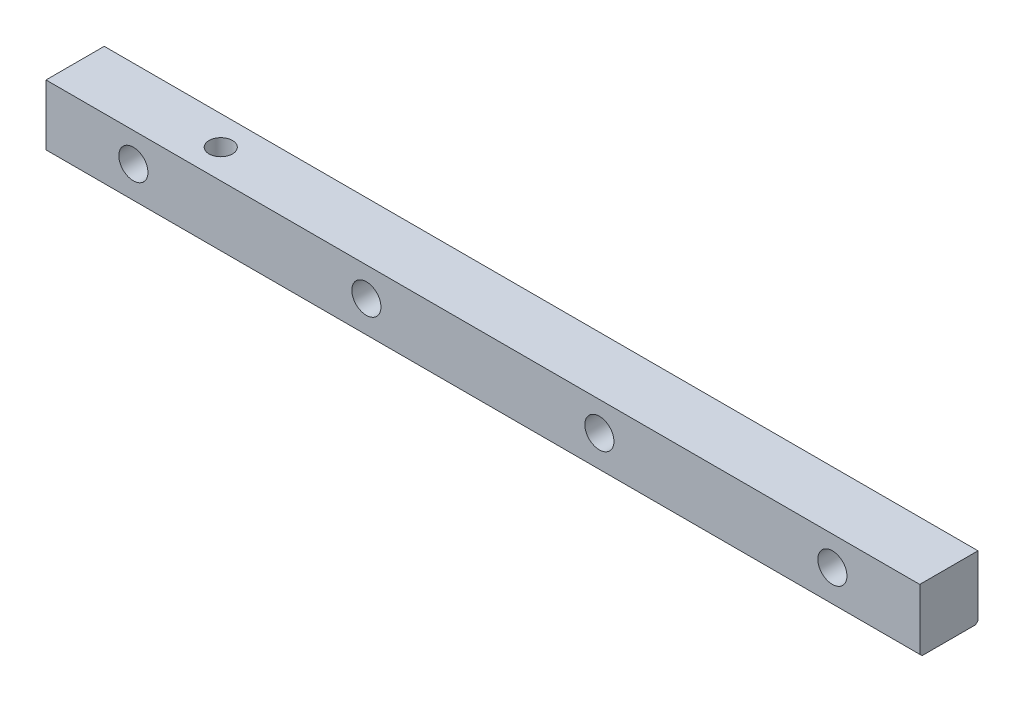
ISO-10303-21;
HEADER;
FILE_DESCRIPTION(('STEP AP214'),'2;1');
FILE_NAME('part.step','',(''),(''),'','','');
FILE_SCHEMA(('AUTOMOTIVE_DESIGN { 1 0 10303 214 1 1 1 1 }'));
ENDSEC;
DATA;
#1=APPLICATION_CONTEXT('core data for automotive mechanical design processes');
#2=APPLICATION_PROTOCOL_DEFINITION('international standard','automotive_design',2000,#1);
#3=PRODUCT_CONTEXT('',#1,'mechanical');
#4=PRODUCT('Part','Part','',(#3));
#5=PRODUCT_RELATED_PRODUCT_CATEGORY('part','',(#4));
#6=PRODUCT_DEFINITION_FORMATION('','',#4);
#7=PRODUCT_DEFINITION_CONTEXT('part definition',#1,'design');
#8=PRODUCT_DEFINITION('design','',#6,#7);
#9=PRODUCT_DEFINITION_SHAPE('','',#8);
#10=(LENGTH_UNIT() NAMED_UNIT(*) SI_UNIT(.MILLI.,.METRE.));
#11=(NAMED_UNIT(*) PLANE_ANGLE_UNIT() SI_UNIT($,.RADIAN.));
#12=(NAMED_UNIT(*) SI_UNIT($,.STERADIAN.) SOLID_ANGLE_UNIT());
#13=UNCERTAINTY_MEASURE_WITH_UNIT(LENGTH_MEASURE(1.E-05),#10,'distance_accuracy_value','');
#14=(GEOMETRIC_REPRESENTATION_CONTEXT(3) GLOBAL_UNCERTAINTY_ASSIGNED_CONTEXT((#13)) GLOBAL_UNIT_ASSIGNED_CONTEXT((#10,
#11,#12)) REPRESENTATION_CONTEXT('',''));
#15=CARTESIAN_POINT('',(0.,0.,0.));
#16=DIRECTION('',(0.,0.,1.));
#17=DIRECTION('',(1.,0.,0.));
#18=AXIS2_PLACEMENT_3D('',#15,#16,#17);
#19=CARTESIAN_POINT('',(-209.55,210.01,12.7));
#20=DIRECTION('',(1.,0.,0.));
#21=DIRECTION('',(0.,0.,-1.));
#22=AXIS2_PLACEMENT_3D('',#19,#20,#21);
#23=PLANE('',#22);
#24=DIRECTION('',(0.,-1.,0.));
#25=VECTOR('',#24,1.);
#26=CARTESIAN_POINT('',(-209.55,210.01,0.));
#27=LINE('',#26,#25);
#28=CARTESIAN_POINT('',(-209.55,210.01,0.));
#29=VERTEX_POINT('',#28);
#30=CARTESIAN_POINT('',(-209.55,196.802,0.));
#31=VERTEX_POINT('',#30);
#32=EDGE_CURVE('E133',#29,#31,#27,.T.);
#33=ORIENTED_EDGE('',*,*,#32,.T.);
#34=DIRECTION('',(0.,0.707106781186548,-0.707106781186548));
#35=VECTOR('',#34,1.);
#36=CARTESIAN_POINT('',(-209.55,196.294,0.508000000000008));
#37=LINE('',#36,#35);
#38=CARTESIAN_POINT('',(-209.55,196.294,0.508000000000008));
#39=VERTEX_POINT('',#38);
#40=EDGE_CURVE('E54',#31,#39,#37,.F.);
#41=ORIENTED_EDGE('',*,*,#40,.T.);
#42=DIRECTION('',(0.,0.,-1.));
#43=VECTOR('',#42,1.);
#44=CARTESIAN_POINT('',(-209.55,196.294,12.7));
#45=LINE('',#44,#43);
#46=CARTESIAN_POINT('',(-209.55,196.294,12.192));
#47=VERTEX_POINT('',#46);
#48=EDGE_CURVE('E144',#47,#39,#45,.T.);
#49=ORIENTED_EDGE('',*,*,#48,.F.);
#50=DIRECTION('',(0.,0.707106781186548,0.707106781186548));
#51=VECTOR('',#50,1.);
#52=CARTESIAN_POINT('',(-209.55,196.802,12.7));
#53=LINE('',#52,#51);
#54=CARTESIAN_POINT('',(-209.55,196.802,12.7));
#55=VERTEX_POINT('',#54);
#56=EDGE_CURVE('E61',#47,#55,#53,.T.);
#57=ORIENTED_EDGE('',*,*,#56,.T.);
#58=DIRECTION('',(0.,-1.,0.));
#59=VECTOR('',#58,1.);
#60=CARTESIAN_POINT('',(-209.55,210.01,12.7));
#61=LINE('',#60,#59);
#62=CARTESIAN_POINT('',(-209.55,210.01,12.7));
#63=VERTEX_POINT('',#62);
#64=EDGE_CURVE('E111',#63,#55,#61,.T.);
#65=ORIENTED_EDGE('',*,*,#64,.F.);
#66=DIRECTION('',(0.,0.,-1.));
#67=VECTOR('',#66,1.);
#68=CARTESIAN_POINT('',(-209.55,210.01,12.7));
#69=LINE('',#68,#67);
#70=EDGE_CURVE('E122',#63,#29,#69,.T.);
#71=ORIENTED_EDGE('',*,*,#70,.T.);
#72=EDGE_LOOP('',(#33,#41,#49,#57,#65,#71));
#73=FACE_BOUND('',#72,.T.);
#74=ADVANCED_FACE('F45',(#73),#23,.F.);
#75=CARTESIAN_POINT('',(-209.55,196.294,12.7));
#76=DIRECTION('',(0.,1.,0.));
#77=DIRECTION('',(0.,0.,1.));
#78=AXIS2_PLACEMENT_3D('',#75,#76,#77);
#79=PLANE('',#78);
#80=CARTESIAN_POINT('',(-177.8,196.294,6.34999999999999));
#81=DIRECTION('',(0.,1.,0.));
#82=DIRECTION('',(-1.,0.,0.));
#83=AXIS2_PLACEMENT_3D('',#80,#81,#82);
#84=CIRCLE('',#83,2.55269999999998);
#85=CARTESIAN_POINT('',(-180.3527,196.294,6.34999999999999));
#86=VERTEX_POINT('',#85);
#87=EDGE_CURVE('E206',#86,#86,#84,.T.);
#88=ORIENTED_EDGE('',*,*,#87,.T.);
#89=EDGE_LOOP('',(#88));
#90=FACE_BOUND('',#89,.T.);
#91=ORIENTED_EDGE('',*,*,#48,.T.);
#92=DIRECTION('',(1.,0.,0.));
#93=VECTOR('',#92,1.);
#94=CARTESIAN_POINT('',(-209.55,196.294,0.508000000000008));
#95=LINE('',#94,#93);
#96=CARTESIAN_POINT('',(-19.05,196.294,0.508000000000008));
#97=VERTEX_POINT('',#96);
#98=EDGE_CURVE('E151',#39,#97,#95,.T.);
#99=ORIENTED_EDGE('',*,*,#98,.T.);
#100=DIRECTION('',(0.,0.,-1.));
#101=VECTOR('',#100,1.);
#102=CARTESIAN_POINT('',(-19.05,196.294,12.7));
#103=LINE('',#102,#101);
#104=CARTESIAN_POINT('',(-19.05,196.294,12.192));
#105=VERTEX_POINT('',#104);
#106=EDGE_CURVE('E121',#105,#97,#103,.T.);
#107=ORIENTED_EDGE('',*,*,#106,.F.);
#108=DIRECTION('',(-1.,0.,0.));
#109=VECTOR('',#108,1.);
#110=CARTESIAN_POINT('',(-209.55,196.294,12.192));
#111=LINE('',#110,#109);
#112=EDGE_CURVE('E148',#105,#47,#111,.T.);
#113=ORIENTED_EDGE('',*,*,#112,.T.);
#114=EDGE_LOOP('',(#91,#99,#107,#113));
#115=FACE_BOUND('',#114,.T.);
#116=ADVANCED_FACE('F170',(#90,#115),#79,.F.);
#117=CARTESIAN_POINT('',(-19.05,210.01,12.7));
#118=DIRECTION('',(-1.,0.,0.));
#119=DIRECTION('',(0.,0.,1.));
#120=AXIS2_PLACEMENT_3D('',#117,#118,#119);
#121=PLANE('',#120);
#122=ORIENTED_EDGE('',*,*,#106,.T.);
#123=DIRECTION('',(0.,-0.707106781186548,0.707106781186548));
#124=VECTOR('',#123,1.);
#125=CARTESIAN_POINT('',(-19.05,196.294,0.508000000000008));
#126=LINE('',#125,#124);
#127=CARTESIAN_POINT('',(-19.05,196.802,0.));
#128=VERTEX_POINT('',#127);
#129=EDGE_CURVE('E158',#97,#128,#126,.F.);
#130=ORIENTED_EDGE('',*,*,#129,.T.);
#131=DIRECTION('',(0.,1.,0.));
#132=VECTOR('',#131,1.);
#133=CARTESIAN_POINT('',(-19.05,210.01,0.));
#134=LINE('',#133,#132);
#135=CARTESIAN_POINT('',(-19.05,210.01,0.));
#136=VERTEX_POINT('',#135);
#137=EDGE_CURVE('E117',#128,#136,#134,.T.);
#138=ORIENTED_EDGE('',*,*,#137,.T.);
#139=DIRECTION('',(0.,0.,-1.));
#140=VECTOR('',#139,1.);
#141=CARTESIAN_POINT('',(-19.05,210.01,12.7));
#142=LINE('',#141,#140);
#143=CARTESIAN_POINT('',(-19.05,210.01,12.7));
#144=VERTEX_POINT('',#143);
#145=EDGE_CURVE('E114',#144,#136,#142,.T.);
#146=ORIENTED_EDGE('',*,*,#145,.F.);
#147=DIRECTION('',(0.,1.,0.));
#148=VECTOR('',#147,1.);
#149=CARTESIAN_POINT('',(-19.05,210.01,12.7));
#150=LINE('',#149,#148);
#151=CARTESIAN_POINT('',(-19.05,196.802,12.7));
#152=VERTEX_POINT('',#151);
#153=EDGE_CURVE('E102',#152,#144,#150,.T.);
#154=ORIENTED_EDGE('',*,*,#153,.F.);
#155=DIRECTION('',(0.,-0.707106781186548,-0.707106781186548));
#156=VECTOR('',#155,1.);
#157=CARTESIAN_POINT('',(-19.05,196.802,12.7));
#158=LINE('',#157,#156);
#159=EDGE_CURVE('E155',#152,#105,#158,.T.);
#160=ORIENTED_EDGE('',*,*,#159,.T.);
#161=EDGE_LOOP('',(#122,#130,#138,#146,#154,#160));
#162=FACE_BOUND('',#161,.T.);
#163=ADVANCED_FACE('F116',(#162),#121,.F.);
#164=CARTESIAN_POINT('',(-209.55,210.01,12.7));
#165=DIRECTION('',(0.,-1.,0.));
#166=DIRECTION('',(1.,0.,0.));
#167=AXIS2_PLACEMENT_3D('',#164,#165,#166);
#168=PLANE('',#167);
#169=CARTESIAN_POINT('',(-177.8,210.01,6.34999999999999));
#170=DIRECTION('',(0.,1.,0.));
#171=DIRECTION('',(-1.,0.,0.));
#172=AXIS2_PLACEMENT_3D('',#169,#170,#171);
#173=CIRCLE('',#172,2.55269999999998);
#174=CARTESIAN_POINT('',(-180.3527,210.01,6.34999999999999));
#175=VERTEX_POINT('',#174);
#176=EDGE_CURVE('E210',#175,#175,#173,.T.);
#177=ORIENTED_EDGE('',*,*,#176,.F.);
#178=EDGE_LOOP('',(#177));
#179=FACE_BOUND('',#178,.T.);
#180=DIRECTION('',(-1.,0.,0.));
#181=VECTOR('',#180,1.);
#182=CARTESIAN_POINT('',(-209.55,210.01,0.));
#183=LINE('',#182,#181);
#184=EDGE_CURVE('E139',#136,#29,#183,.T.);
#185=ORIENTED_EDGE('',*,*,#184,.T.);
#186=ORIENTED_EDGE('',*,*,#70,.F.);
#187=DIRECTION('',(-1.,0.,0.));
#188=VECTOR('',#187,1.);
#189=CARTESIAN_POINT('',(-209.55,210.01,12.7));
#190=LINE('',#189,#188);
#191=EDGE_CURVE('E106',#144,#63,#190,.T.);
#192=ORIENTED_EDGE('',*,*,#191,.F.);
#193=ORIENTED_EDGE('',*,*,#145,.T.);
#194=EDGE_LOOP('',(#185,#186,#192,#193));
#195=FACE_BOUND('',#194,.T.);
#196=ADVANCED_FACE('F124',(#179,#195),#168,.F.);
#197=CARTESIAN_POINT('',(-209.55,196.294,12.7));
#198=DIRECTION('',(0.,0.,1.));
#199=DIRECTION('',(1.,0.,0.));
#200=AXIS2_PLACEMENT_3D('',#197,#198,#199);
#201=PLANE('',#200);
#202=CARTESIAN_POINT('',(-38.1,203.66,12.7));
#203=DIRECTION('',(0.,0.,1.));
#204=DIRECTION('',(1.,0.,0.));
#205=AXIS2_PLACEMENT_3D('',#202,#203,#204);
#206=CIRCLE('',#205,3.175);
#207=CARTESIAN_POINT('',(-34.925,203.66,12.7));
#208=VERTEX_POINT('',#207);
#209=EDGE_CURVE('E202',#208,#208,#206,.T.);
#210=ORIENTED_EDGE('',*,*,#209,.F.);
#211=EDGE_LOOP('',(#210));
#212=FACE_BOUND('',#211,.T.);
#213=CARTESIAN_POINT('',(-88.9,203.66,12.7));
#214=DIRECTION('',(0.,0.,1.));
#215=DIRECTION('',(1.,0.,0.));
#216=AXIS2_PLACEMENT_3D('',#213,#214,#215);
#217=CIRCLE('',#216,3.175);
#218=CARTESIAN_POINT('',(-85.725,203.66,12.7));
#219=VERTEX_POINT('',#218);
#220=EDGE_CURVE('E194',#219,#219,#217,.T.);
#221=ORIENTED_EDGE('',*,*,#220,.F.);
#222=EDGE_LOOP('',(#221));
#223=FACE_BOUND('',#222,.T.);
#224=CARTESIAN_POINT('',(-139.7,203.66,12.7));
#225=DIRECTION('',(0.,0.,1.));
#226=DIRECTION('',(1.,0.,0.));
#227=AXIS2_PLACEMENT_3D('',#224,#225,#226);
#228=CIRCLE('',#227,3.175);
#229=CARTESIAN_POINT('',(-136.525,203.66,12.7));
#230=VERTEX_POINT('',#229);
#231=EDGE_CURVE('E186',#230,#230,#228,.T.);
#232=ORIENTED_EDGE('',*,*,#231,.F.);
#233=EDGE_LOOP('',(#232));
#234=FACE_BOUND('',#233,.T.);
#235=CARTESIAN_POINT('',(-190.5,203.66,12.7));
#236=DIRECTION('',(0.,0.,1.));
#237=DIRECTION('',(1.,0.,0.));
#238=AXIS2_PLACEMENT_3D('',#235,#236,#237);
#239=CIRCLE('',#238,3.175);
#240=CARTESIAN_POINT('',(-187.325,203.66,12.7));
#241=VERTEX_POINT('',#240);
#242=EDGE_CURVE('E178',#241,#241,#239,.T.);
#243=ORIENTED_EDGE('',*,*,#242,.F.);
#244=EDGE_LOOP('',(#243));
#245=FACE_BOUND('',#244,.T.);
#246=ORIENTED_EDGE('',*,*,#64,.T.);
#247=DIRECTION('',(1.,0.,0.));
#248=VECTOR('',#247,1.);
#249=CARTESIAN_POINT('',(-19.05,196.802,12.7));
#250=LINE('',#249,#248);
#251=EDGE_CURVE('E11',#55,#152,#250,.T.);
#252=ORIENTED_EDGE('',*,*,#251,.T.);
#253=ORIENTED_EDGE('',*,*,#153,.T.);
#254=ORIENTED_EDGE('',*,*,#191,.T.);
#255=EDGE_LOOP('',(#246,#252,#253,#254));
#256=FACE_BOUND('',#255,.T.);
#257=ADVANCED_FACE('F104',(#212,#223,#234,#245,#256),#201,.T.);
#258=CARTESIAN_POINT('',(-209.55,196.294,0.));
#259=DIRECTION('',(0.,0.,1.));
#260=DIRECTION('',(1.,0.,0.));
#261=AXIS2_PLACEMENT_3D('',#258,#259,#260);
#262=PLANE('',#261);
#263=CARTESIAN_POINT('',(-38.1,203.66,0.));
#264=DIRECTION('',(0.,0.,1.));
#265=DIRECTION('',(1.,0.,0.));
#266=AXIS2_PLACEMENT_3D('',#263,#264,#265);
#267=CIRCLE('',#266,3.175);
#268=CARTESIAN_POINT('',(-34.925,203.66,0.));
#269=VERTEX_POINT('',#268);
#270=EDGE_CURVE('E198',#269,#269,#267,.T.);
#271=ORIENTED_EDGE('',*,*,#270,.T.);
#272=EDGE_LOOP('',(#271));
#273=FACE_BOUND('',#272,.T.);
#274=CARTESIAN_POINT('',(-88.9,203.66,0.));
#275=DIRECTION('',(0.,0.,1.));
#276=DIRECTION('',(1.,0.,0.));
#277=AXIS2_PLACEMENT_3D('',#274,#275,#276);
#278=CIRCLE('',#277,3.175);
#279=CARTESIAN_POINT('',(-85.725,203.66,0.));
#280=VERTEX_POINT('',#279);
#281=EDGE_CURVE('E190',#280,#280,#278,.T.);
#282=ORIENTED_EDGE('',*,*,#281,.T.);
#283=EDGE_LOOP('',(#282));
#284=FACE_BOUND('',#283,.T.);
#285=CARTESIAN_POINT('',(-139.7,203.66,0.));
#286=DIRECTION('',(0.,0.,1.));
#287=DIRECTION('',(1.,0.,0.));
#288=AXIS2_PLACEMENT_3D('',#285,#286,#287);
#289=CIRCLE('',#288,3.175);
#290=CARTESIAN_POINT('',(-136.525,203.66,0.));
#291=VERTEX_POINT('',#290);
#292=EDGE_CURVE('E182',#291,#291,#289,.T.);
#293=ORIENTED_EDGE('',*,*,#292,.T.);
#294=EDGE_LOOP('',(#293));
#295=FACE_BOUND('',#294,.T.);
#296=CARTESIAN_POINT('',(-190.5,203.66,0.));
#297=DIRECTION('',(0.,0.,1.));
#298=DIRECTION('',(1.,0.,0.));
#299=AXIS2_PLACEMENT_3D('',#296,#297,#298);
#300=CIRCLE('',#299,3.175);
#301=CARTESIAN_POINT('',(-187.325,203.66,0.));
#302=VERTEX_POINT('',#301);
#303=EDGE_CURVE('E136',#302,#302,#300,.T.);
#304=ORIENTED_EDGE('',*,*,#303,.T.);
#305=EDGE_LOOP('',(#304));
#306=FACE_BOUND('',#305,.T.);
#307=ORIENTED_EDGE('',*,*,#137,.F.);
#308=DIRECTION('',(-1.,0.,0.));
#309=VECTOR('',#308,1.);
#310=CARTESIAN_POINT('',(-209.55,196.802,0.));
#311=LINE('',#310,#309);
#312=EDGE_CURVE('E69',#128,#31,#311,.T.);
#313=ORIENTED_EDGE('',*,*,#312,.T.);
#314=ORIENTED_EDGE('',*,*,#32,.F.);
#315=ORIENTED_EDGE('',*,*,#184,.F.);
#316=EDGE_LOOP('',(#307,#313,#314,#315));
#317=FACE_BOUND('',#316,.T.);
#318=ADVANCED_FACE('F174',(#273,#284,#295,#306,#317),#262,.F.);
#319=CARTESIAN_POINT('',(-190.5,203.66,0.));
#320=DIRECTION('',(0.,0.,1.));
#321=DIRECTION('',(1.,0.,0.));
#322=AXIS2_PLACEMENT_3D('',#319,#320,#321);
#323=CYLINDRICAL_SURFACE('',#322,3.175);
#324=ORIENTED_EDGE('',*,*,#303,.F.);
#325=EDGE_LOOP('',(#324));
#326=FACE_BOUND('',#325,.T.);
#327=ORIENTED_EDGE('',*,*,#242,.T.);
#328=EDGE_LOOP('',(#327));
#329=FACE_BOUND('',#328,.T.);
#330=ADVANCED_FACE('F263',(#326,#329),#323,.F.);
#331=CARTESIAN_POINT('',(-139.7,203.66,0.));
#332=DIRECTION('',(0.,0.,1.));
#333=DIRECTION('',(1.,0.,0.));
#334=AXIS2_PLACEMENT_3D('',#331,#332,#333);
#335=CYLINDRICAL_SURFACE('',#334,3.175);
#336=ORIENTED_EDGE('',*,*,#292,.F.);
#337=EDGE_LOOP('',(#336));
#338=FACE_BOUND('',#337,.T.);
#339=ORIENTED_EDGE('',*,*,#231,.T.);
#340=EDGE_LOOP('',(#339));
#341=FACE_BOUND('',#340,.T.);
#342=ADVANCED_FACE('F255',(#338,#341),#335,.F.);
#343=CARTESIAN_POINT('',(-88.9,203.66,0.));
#344=DIRECTION('',(0.,0.,1.));
#345=DIRECTION('',(1.,0.,0.));
#346=AXIS2_PLACEMENT_3D('',#343,#344,#345);
#347=CYLINDRICAL_SURFACE('',#346,3.175);
#348=ORIENTED_EDGE('',*,*,#281,.F.);
#349=EDGE_LOOP('',(#348));
#350=FACE_BOUND('',#349,.T.);
#351=ORIENTED_EDGE('',*,*,#220,.T.);
#352=EDGE_LOOP('',(#351));
#353=FACE_BOUND('',#352,.T.);
#354=ADVANCED_FACE('F249',(#350,#353),#347,.F.);
#355=CARTESIAN_POINT('',(-38.1,203.66,0.));
#356=DIRECTION('',(0.,0.,1.));
#357=DIRECTION('',(1.,0.,0.));
#358=AXIS2_PLACEMENT_3D('',#355,#356,#357);
#359=CYLINDRICAL_SURFACE('',#358,3.175);
#360=ORIENTED_EDGE('',*,*,#270,.F.);
#361=EDGE_LOOP('',(#360));
#362=FACE_BOUND('',#361,.T.);
#363=ORIENTED_EDGE('',*,*,#209,.T.);
#364=EDGE_LOOP('',(#363));
#365=FACE_BOUND('',#364,.T.);
#366=ADVANCED_FACE('F243',(#362,#365),#359,.F.);
#367=CARTESIAN_POINT('',(-209.55,196.294,0.508000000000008));
#368=DIRECTION('',(0.,0.707106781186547,0.707106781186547));
#369=DIRECTION('',(0.,-0.707106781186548,0.707106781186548));
#370=AXIS2_PLACEMENT_3D('',#367,#368,#369);
#371=PLANE('',#370);
#372=ORIENTED_EDGE('',*,*,#40,.F.);
#373=ORIENTED_EDGE('',*,*,#312,.F.);
#374=ORIENTED_EDGE('',*,*,#129,.F.);
#375=ORIENTED_EDGE('',*,*,#98,.F.);
#376=EDGE_LOOP('',(#372,#373,#374,#375));
#377=FACE_BOUND('',#376,.T.);
#378=ADVANCED_FACE('F173',(#377),#371,.F.);
#379=CARTESIAN_POINT('',(-209.55,196.802,12.7));
#380=DIRECTION('',(0.,-0.707106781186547,0.707106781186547));
#381=DIRECTION('',(0.,-0.707106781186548,-0.707106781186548));
#382=AXIS2_PLACEMENT_3D('',#379,#380,#381);
#383=PLANE('',#382);
#384=ORIENTED_EDGE('',*,*,#56,.F.);
#385=ORIENTED_EDGE('',*,*,#112,.F.);
#386=ORIENTED_EDGE('',*,*,#159,.F.);
#387=ORIENTED_EDGE('',*,*,#251,.F.);
#388=EDGE_LOOP('',(#384,#385,#386,#387));
#389=FACE_BOUND('',#388,.T.);
#390=ADVANCED_FACE('F47',(#389),#383,.T.);
#391=CARTESIAN_POINT('',(-177.8,196.294,6.34999999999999));
#392=DIRECTION('',(0.,1.,0.));
#393=DIRECTION('',(-1.,0.,0.));
#394=AXIS2_PLACEMENT_3D('',#391,#392,#393);
#395=CYLINDRICAL_SURFACE('',#394,2.55269999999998);
#396=ORIENTED_EDGE('',*,*,#87,.F.);
#397=EDGE_LOOP('',(#396));
#398=FACE_BOUND('',#397,.T.);
#399=ORIENTED_EDGE('',*,*,#176,.T.);
#400=EDGE_LOOP('',(#399));
#401=FACE_BOUND('',#400,.T.);
#402=ADVANCED_FACE('F220',(#398,#401),#395,.F.);
#403=CLOSED_SHELL('',(#74,#116,#163,#196,#257,#318,#330,#342,#354,#366,#378,#390,#402));
#404=MANIFOLD_SOLID_BREP('B2',#403);
#405=ADVANCED_BREP_SHAPE_REPRESENTATION('',(#18,#404),#14);
#406=SHAPE_DEFINITION_REPRESENTATION(#9,#405);
ENDSEC;
END-ISO-10303-21;
